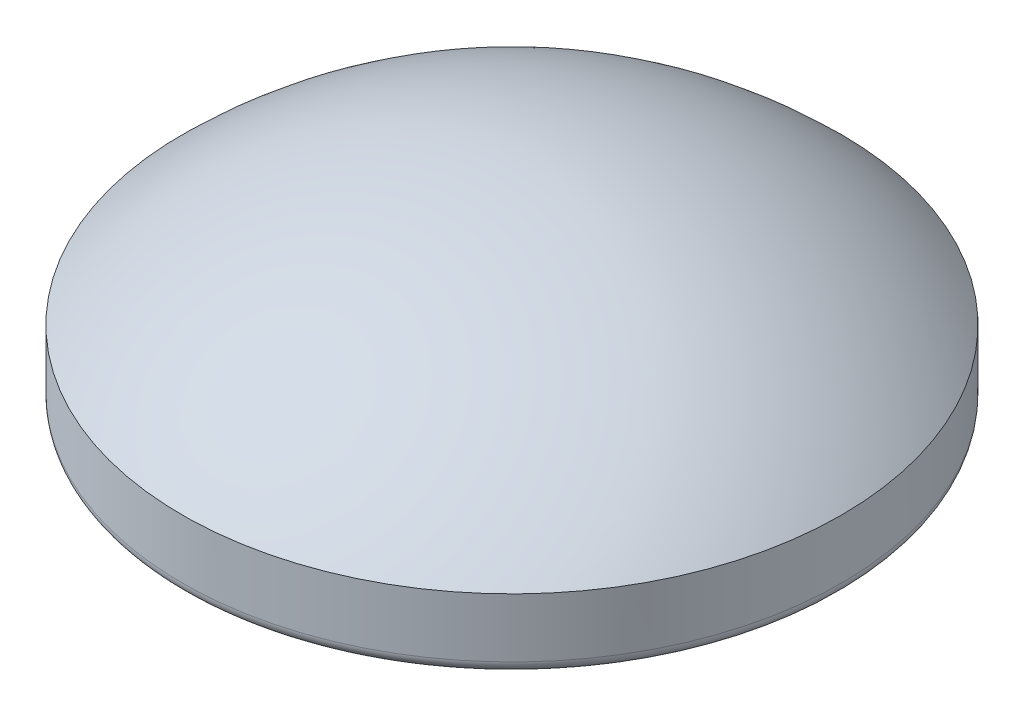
ISO-10303-21;
HEADER;
FILE_DESCRIPTION(('STEP AP214'),'2;1');
FILE_NAME('part.step','',(''),(''),'','','');
FILE_SCHEMA(('AUTOMOTIVE_DESIGN { 1 0 10303 214 1 1 1 1 }'));
ENDSEC;
DATA;
#1=APPLICATION_CONTEXT('core data for automotive mechanical design processes');
#2=APPLICATION_PROTOCOL_DEFINITION('international standard','automotive_design',2000,#1);
#3=PRODUCT_CONTEXT('',#1,'mechanical');
#4=PRODUCT('Part','Part','',(#3));
#5=PRODUCT_RELATED_PRODUCT_CATEGORY('part','',(#4));
#6=PRODUCT_DEFINITION_FORMATION('','',#4);
#7=PRODUCT_DEFINITION_CONTEXT('part definition',#1,'design');
#8=PRODUCT_DEFINITION('design','',#6,#7);
#9=PRODUCT_DEFINITION_SHAPE('','',#8);
#10=(LENGTH_UNIT() NAMED_UNIT(*) SI_UNIT(.MILLI.,.METRE.));
#11=(NAMED_UNIT(*) PLANE_ANGLE_UNIT() SI_UNIT($,.RADIAN.));
#12=(NAMED_UNIT(*) SI_UNIT($,.STERADIAN.) SOLID_ANGLE_UNIT());
#13=UNCERTAINTY_MEASURE_WITH_UNIT(LENGTH_MEASURE(1.E-05),#10,'distance_accuracy_value','');
#14=(GEOMETRIC_REPRESENTATION_CONTEXT(3) GLOBAL_UNCERTAINTY_ASSIGNED_CONTEXT((#13)) GLOBAL_UNIT_ASSIGNED_CONTEXT((#10,
#11,#12)) REPRESENTATION_CONTEXT('',''));
#15=CARTESIAN_POINT('',(0.,0.,0.));
#16=DIRECTION('',(0.,0.,1.));
#17=DIRECTION('',(1.,0.,0.));
#18=AXIS2_PLACEMENT_3D('',#15,#16,#17);
#19=CARTESIAN_POINT('',(25.1,0.,0.));
#20=DIRECTION('',(0.,-1.,0.));
#21=DIRECTION('',(0.,0.,-1.));
#22=AXIS2_PLACEMENT_3D('',#19,#20,#21);
#23=PLANE('',#22);
#24=CARTESIAN_POINT('',(0.,0.,0.));
#25=DIRECTION('',(0.,-1.,0.));
#26=DIRECTION('',(0.,0.,-1.));
#27=AXIS2_PLACEMENT_3D('',#24,#25,#26);
#28=CIRCLE('',#27,26.1);
#29=CARTESIAN_POINT('',(0.,0.,-26.1));
#30=VERTEX_POINT('',#29);
#31=EDGE_CURVE('E43',#30,#30,#28,.T.);
#32=ORIENTED_EDGE('',*,*,#31,.T.);
#33=EDGE_LOOP('',(#32));
#34=FACE_BOUND('',#33,.T.);
#35=CARTESIAN_POINT('',(0.,0.,0.));
#36=DIRECTION('',(0.,-1.,0.));
#37=DIRECTION('',(0.,0.,-1.));
#38=AXIS2_PLACEMENT_3D('',#35,#36,#37);
#39=CIRCLE('',#38,25.1);
#40=CARTESIAN_POINT('',(0.,0.,-25.1));
#41=VERTEX_POINT('',#40);
#42=EDGE_CURVE('E10',#41,#41,#39,.T.);
#43=ORIENTED_EDGE('',*,*,#42,.F.);
#44=EDGE_LOOP('',(#43));
#45=FACE_BOUND('',#44,.T.);
#46=ADVANCED_FACE('F24',(#34,#45),#23,.T.);
#47=CARTESIAN_POINT('',(0.,0.,0.));
#48=DIRECTION('',(0.,-1.,0.));
#49=DIRECTION('',(0.,0.,-1.));
#50=AXIS2_PLACEMENT_3D('',#47,#48,#49);
#51=CYLINDRICAL_SURFACE('',#50,25.1);
#52=ORIENTED_EDGE('',*,*,#42,.T.);
#53=EDGE_LOOP('',(#52));
#54=FACE_BOUND('',#53,.T.);
#55=CARTESIAN_POINT('',(0.,5.,0.));
#56=DIRECTION('',(0.,-1.,0.));
#57=DIRECTION('',(0.,0.,-1.));
#58=AXIS2_PLACEMENT_3D('',#55,#56,#57);
#59=CIRCLE('',#58,25.1);
#60=CARTESIAN_POINT('',(0.,5.,-25.1));
#61=VERTEX_POINT('',#60);
#62=EDGE_CURVE('E30',#61,#61,#59,.T.);
#63=ORIENTED_EDGE('',*,*,#62,.F.);
#64=EDGE_LOOP('',(#63));
#65=FACE_BOUND('',#64,.T.);
#66=ADVANCED_FACE('F61',(#54,#65),#51,.F.);
#67=CARTESIAN_POINT('',(0.,-21.5005,0.));
#68=DIRECTION('',(0.,-1.,0.));
#69=DIRECTION('',(1.,0.,0.));
#70=AXIS2_PLACEMENT_3D('',#67,#68,#69);
#71=SPHERICAL_SURFACE('',#70,36.5005);
#72=ORIENTED_EDGE('',*,*,#62,.T.);
#73=EDGE_LOOP('',(#72));
#74=FACE_BOUND('',#73,.T.);
#75=ADVANCED_FACE('F65',(#74),#71,.F.);
#76=CARTESIAN_POINT('',(0.,-21.5005,0.));
#77=DIRECTION('',(0.,-1.,0.));
#78=DIRECTION('',(1.,0.,0.));
#79=AXIS2_PLACEMENT_3D('',#76,#77,#78);
#80=SPHERICAL_SURFACE('',#79,38.5005);
#81=CARTESIAN_POINT('',(0.,5.84686733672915,0.));
#82=DIRECTION('',(0.,-1.,0.));
#83=DIRECTION('',(0.,0.,-1.));
#84=AXIS2_PLACEMENT_3D('',#81,#82,#83);
#85=CIRCLE('',#84,27.1);
#86=CARTESIAN_POINT('',(0.,5.84686733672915,-27.1));
#87=VERTEX_POINT('',#86);
#88=EDGE_CURVE('E34',#87,#87,#85,.T.);
#89=ORIENTED_EDGE('',*,*,#88,.F.);
#90=EDGE_LOOP('',(#89));
#91=FACE_BOUND('',#90,.T.);
#92=ADVANCED_FACE('F57',(#91),#80,.T.);
#93=CARTESIAN_POINT('',(0.,0.,0.));
#94=DIRECTION('',(0.,-1.,0.));
#95=DIRECTION('',(0.,0.,-1.));
#96=AXIS2_PLACEMENT_3D('',#93,#94,#95);
#97=CYLINDRICAL_SURFACE('',#96,27.1);
#98=ORIENTED_EDGE('',*,*,#88,.T.);
#99=EDGE_LOOP('',(#98));
#100=FACE_BOUND('',#99,.T.);
#101=CARTESIAN_POINT('',(0.,1.,0.));
#102=DIRECTION('',(0.,-1.,0.));
#103=DIRECTION('',(0.,0.,-1.));
#104=AXIS2_PLACEMENT_3D('',#101,#102,#103);
#105=CIRCLE('',#104,27.1);
#106=CARTESIAN_POINT('',(0.,1.,-27.1));
#107=VERTEX_POINT('',#106);
#108=EDGE_CURVE('E38',#107,#107,#105,.T.);
#109=ORIENTED_EDGE('',*,*,#108,.F.);
#110=EDGE_LOOP('',(#109));
#111=FACE_BOUND('',#110,.T.);
#112=ADVANCED_FACE('F51',(#100,#111),#97,.T.);
#113=CARTESIAN_POINT('',(0.,1.,0.));
#114=DIRECTION('',(0.,-1.,0.));
#115=DIRECTION('',(0.,0.,-1.));
#116=AXIS2_PLACEMENT_3D('',#113,#114,#115);
#117=TOROIDAL_SURFACE('',#116,26.1,0.999999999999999);
#118=ORIENTED_EDGE('',*,*,#108,.T.);
#119=EDGE_LOOP('',(#118));
#120=FACE_BOUND('',#119,.T.);
#121=ORIENTED_EDGE('',*,*,#31,.F.);
#122=EDGE_LOOP('',(#121));
#123=FACE_BOUND('',#122,.T.);
#124=ADVANCED_FACE('F49',(#120,#123),#117,.T.);
#125=CLOSED_SHELL('',(#46,#66,#75,#92,#112,#124));
#126=MANIFOLD_SOLID_BREP('B2',#125);
#127=ADVANCED_BREP_SHAPE_REPRESENTATION('',(#18,#126),#14);
#128=SHAPE_DEFINITION_REPRESENTATION(#9,#127);
ENDSEC;
END-ISO-10303-21;
